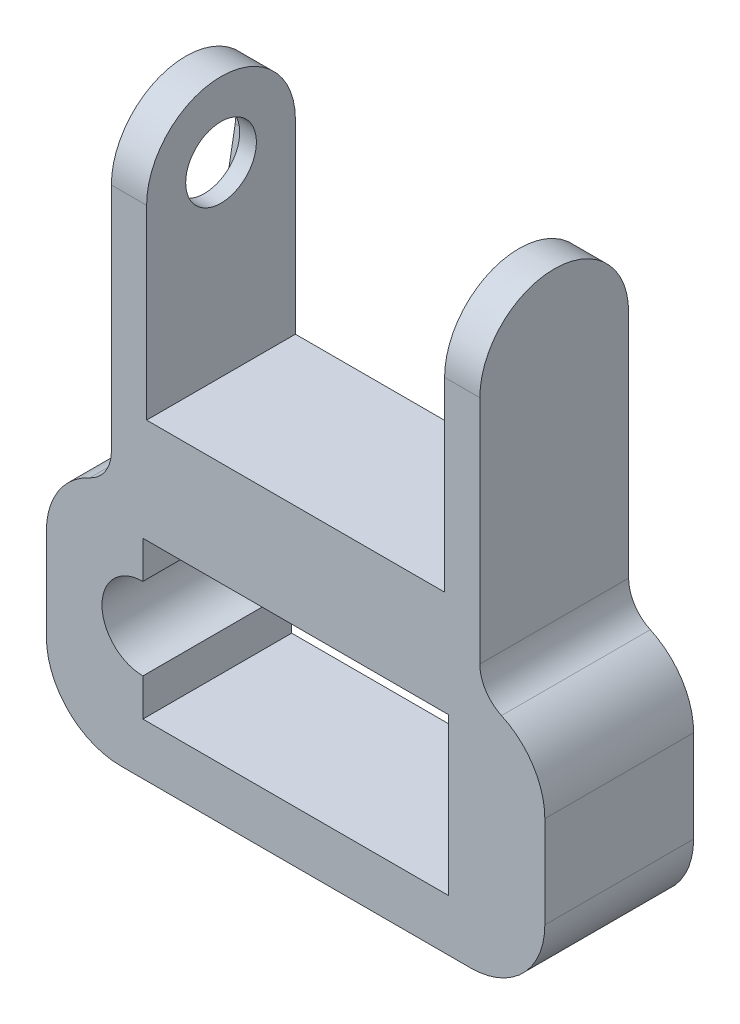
from build123d import *

# Parameters (mm, degrees)
SKETCH1_W           = 75
SKETCH1_H           = 85
BOSS_EXTRUDE1_DEPTH = 20
SKETCH2_W           = 40.05
SKETCH2_H           = 35
CUT_EXTRUDE1_DEPTH  = 61.104076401
CUT_EXTRUDE2_DEPTH  = 61.104076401
CUT_EXTRUDE4_DEPTH  = 89.494350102
SKETCH4_W           = 8
SKETCH4_H           = 42.5
CUT_EXTRUDE5_DEPTH  = 61.104076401
SKETCH6_W           = 75
SKETCH6_H           = 8
CUT_EXTRUDE6_DEPTH  = 61.104076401
SKETCH8_R           = 4.75
CUT_EXTRUDE8_DEPTH  = 10
CUT_EXTRUDE9_DEPTH  = 4
CUT_EXTRUDE11_DEPTH = 61.104076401
CUT_EXTRUDE12_DEPTH = 2.5
FILLET1_R           = 5
FILLET2_R           = 10
FILLET3_R           = 10


with BuildPart() as part:
    # Sketch1 → Boss-Extrude1 (new body)
    with BuildSketch(Plane.XY):
        Rectangle(SKETCH1_W, SKETCH1_H)
    extrude(amount=BOSS_EXTRUDE1_DEPTH)

    # Sketch2 → Cut-Extrude1 (cut, through all)
    with BuildSketch(Plane.XY.offset(20)):
        with Locations((0, 25)):
            Rectangle(SKETCH2_W, SKETCH2_H)
    extrude(amount=-CUT_EXTRUDE1_DEPTH, mode=Mode.SUBTRACT)

    # Sketch3 → Cut-Extrude2 (cut, through all)
    with BuildSketch(Plane.XY.offset(20)):
        with BuildLine():
            Line((-20.525, -27.55), (20.525, -27.55))
            Line((20.525, -27.55), (20.525, -6.5))
            Line((20.525, -6.5), (-20.525, -6.5))
            Line((-20.525, -6.5), (-20.525, -11.525))
            ThreePointArc((-20.525, -11.525), (-26.025, -17.025), (-20.525, -22.525))
            Line((-20.525, -22.525), (-20.525, -27.55))
        make_face()
    extrude(amount=-CUT_EXTRUDE2_DEPTH, mode=Mode.SUBTRACT)

    # Sketch5 → Cut-Extrude4 (cut, through all)
    with BuildSketch(Plane.ZY.offset(37.5)):
        with BuildLine():
            Line((20, 32.5), (25, 32.5))
            Line((25, 32.5), (25, 57.5))
            Line((25, 57.5), (-5, 57.5))
            Line((-5, 57.5), (-5, 32.5))
            Line((-5, 32.5), (0, 32.5))
            ThreePointArc((0, 32.5), (10, 42.5), (20, 32.5))
        make_face()
    extrude(amount=-CUT_EXTRUDE4_DEPTH, mode=Mode.SUBTRACT)

    # Sketch4 → Cut-Extrude5 (cut, through all)
    with BuildSketch(Plane.XY.offset(20)):
        with Locations((-33.5, 21.25)):
            Rectangle(SKETCH4_W, SKETCH4_H)
        with Locations((33.5, 21.25)):
            Rectangle(SKETCH4_W, SKETCH4_H)
    extrude(amount=-CUT_EXTRUDE5_DEPTH, mode=Mode.SUBTRACT)

    # Sketch6 → Cut-Extrude6 (cut, through all)
    with BuildSketch(Plane.XY.offset(20)):
        with Locations((0, -38.5)):
            Rectangle(SKETCH6_W, SKETCH6_H)
    extrude(amount=-CUT_EXTRUDE6_DEPTH, mode=Mode.SUBTRACT)

    # Sketch8 → Cut-Extrude8 (cut)
    with BuildSketch(Plane.ZY.offset(29.5)):
        with Locations((10, 32.5)):
            Circle(SKETCH8_R)
    extrude(amount=-CUT_EXTRUDE8_DEPTH, mode=Mode.SUBTRACT)

    # Sketch9 → Cut-Extrude9 (cut)
    with BuildSketch(Plane.ZY.offset(29.5)):
        with BuildLine():
            Line((15.5, 32.5), (14, 10))
            ThreePointArc((14, 10), (10, 6), (6, 10))
            Line((6, 10), (4.5, 32.5))
            ThreePointArc((4.5, 32.5), (10, 38), (15.5, 32.5))
        make_face()
    extrude(amount=-CUT_EXTRUDE9_DEPTH, mode=Mode.SUBTRACT)

    # Sketch11 → Cut-Extrude11 (cut, through all)
    with BuildSketch(Plane.XY.offset(20)):
        Polygon((-24.7625, 42.5), (-24.7625, -3.5), (-33.5, -3.5), (-33.5, -34.5), (-37.5, -34.5), (-37.5, 0), (-29.5, 0), (-29.5, 42.5), align=None)
        Polygon((29.5, 0), (29.5, 42.5), (24.7625, 42.5), (24.7625, -3.5), (33.5, -3.5), (33.5, -34.5), (37.5, -34.5), (37.5, 0), align=None)
    extrude(amount=-CUT_EXTRUDE11_DEPTH, mode=Mode.SUBTRACT)

    # Sketch12 → Cut-Extrude12 (cut)
    with BuildSketch(Plane.ZY.offset(24.7625)):
        with BuildLine():
            Line((3.355935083, 31.308823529), (6.308852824, 14.838235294))
            ThreePointArc((6.308852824, 14.838235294), (10.011088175, 11.750016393), (13.694996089, 14.860075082))
            Line((13.694996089, 14.860075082), (16.75, 32.5))
            ThreePointArc((16.75, 32.5), (9.402061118, 39.223464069), (3.355935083, 31.308823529))
        make_face()
    extrude(amount=-CUT_EXTRUDE12_DEPTH, mode=Mode.SUBTRACT)

    # Fillet1
    fillet1_edges = [part.edges().sort_by_distance(p)[0] for p in [
        (-24.7625, -3.5, 10),
        (24.7625, -3.5, 10),
    ]]
    fillet(fillet1_edges, radius=FILLET1_R)

    # Fillet2
    fillet2_edges = [part.edges().sort_by_distance(p)[0] for p in [
        (33.5, -3.5, 10),
        (-33.5, -3.5, 10),
    ]]
    fillet(fillet2_edges, radius=FILLET2_R)

    # Fillet3
    fillet3_edges = [part.edges().sort_by_distance(p)[0] for p in [
        (-33.5, -34.5, 10),
        (33.5, -34.5, 10),
    ]]
    fillet(fillet3_edges, radius=FILLET3_R)


solid = part.part
